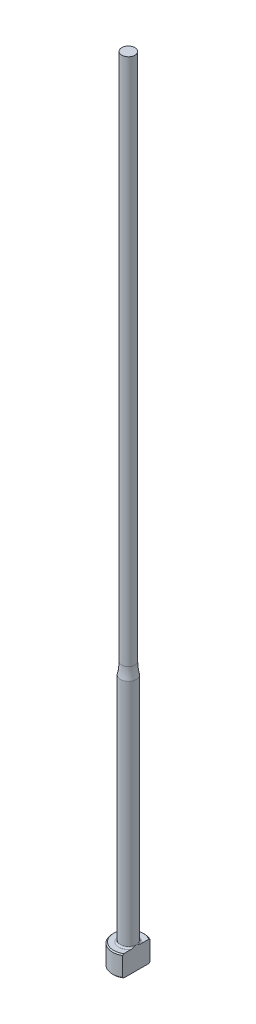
ISO-10303-21;
HEADER;
FILE_DESCRIPTION(('STEP AP214'),'2;1');
FILE_NAME('part.step','',(''),(''),'','','');
FILE_SCHEMA(('AUTOMOTIVE_DESIGN { 1 0 10303 214 1 1 1 1 }'));
ENDSEC;
DATA;
#1=APPLICATION_CONTEXT('core data for automotive mechanical design processes');
#2=APPLICATION_PROTOCOL_DEFINITION('international standard','automotive_design',2000,#1);
#3=PRODUCT_CONTEXT('',#1,'mechanical');
#4=PRODUCT('Part','Part','',(#3));
#5=PRODUCT_RELATED_PRODUCT_CATEGORY('part','',(#4));
#6=PRODUCT_DEFINITION_FORMATION('','',#4);
#7=PRODUCT_DEFINITION_CONTEXT('part definition',#1,'design');
#8=PRODUCT_DEFINITION('design','',#6,#7);
#9=PRODUCT_DEFINITION_SHAPE('','',#8);
#10=(LENGTH_UNIT() NAMED_UNIT(*) SI_UNIT(.MILLI.,.METRE.));
#11=(NAMED_UNIT(*) PLANE_ANGLE_UNIT() SI_UNIT($,.RADIAN.));
#12=(NAMED_UNIT(*) SI_UNIT($,.STERADIAN.) SOLID_ANGLE_UNIT());
#13=UNCERTAINTY_MEASURE_WITH_UNIT(LENGTH_MEASURE(1.E-05),#10,'distance_accuracy_value','');
#14=(GEOMETRIC_REPRESENTATION_CONTEXT(3) GLOBAL_UNCERTAINTY_ASSIGNED_CONTEXT((#13)) GLOBAL_UNIT_ASSIGNED_CONTEXT((#10,
#11,#12)) REPRESENTATION_CONTEXT('',''));
#15=CARTESIAN_POINT('',(0.,0.,0.));
#16=DIRECTION('',(0.,0.,1.));
#17=DIRECTION('',(1.,0.,0.));
#18=AXIS2_PLACEMENT_3D('',#15,#16,#17);
#19=CARTESIAN_POINT('',(-2.99999999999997,4.,0.));
#20=DIRECTION('',(0.,1.,0.));
#21=DIRECTION('',(0.,0.,1.));
#22=AXIS2_PLACEMENT_3D('',#19,#20,#21);
#23=PLANE('',#22);
#24=CARTESIAN_POINT('',(0.,4.,0.));
#25=DIRECTION('',(0.,1.,0.));
#26=DIRECTION('',(0.,0.,1.));
#27=AXIS2_PLACEMENT_3D('',#24,#25,#26);
#28=CIRCLE('',#27,2.79999999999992);
#29=CARTESIAN_POINT('',(1.49999999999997,4.,-2.3643180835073));
#30=VERTEX_POINT('',#29);
#31=CARTESIAN_POINT('',(1.49999999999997,4.,2.3643180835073));
#32=VERTEX_POINT('',#31);
#33=EDGE_CURVE('E187',#30,#32,#28,.T.);
#34=ORIENTED_EDGE('',*,*,#33,.T.);
#35=DIRECTION('',(0.,0.,-1.));
#36=VECTOR('',#35,1.);
#37=CARTESIAN_POINT('',(1.49999999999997,4.,0.));
#38=LINE('',#37,#36);
#39=CARTESIAN_POINT('',(1.49999999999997,4.00000000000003,0.994987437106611));
#40=VERTEX_POINT('',#39);
#41=EDGE_CURVE('E57',#32,#40,#38,.T.);
#42=ORIENTED_EDGE('',*,*,#41,.T.);
#43=CARTESIAN_POINT('',(0.,4.,0.));
#44=DIRECTION('',(0.,1.,0.));
#45=DIRECTION('',(0.,0.,1.));
#46=AXIS2_PLACEMENT_3D('',#43,#44,#45);
#47=CIRCLE('',#46,1.79999999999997);
#48=CARTESIAN_POINT('',(1.49999999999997,4.00000000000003,-0.994987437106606));
#49=VERTEX_POINT('',#48);
#50=EDGE_CURVE('E108',#40,#49,#47,.F.);
#51=ORIENTED_EDGE('',*,*,#50,.T.);
#52=EDGE_CURVE('E137',#49,#30,#38,.T.);
#53=ORIENTED_EDGE('',*,*,#52,.T.);
#54=EDGE_LOOP('',(#34,#42,#51,#53));
#55=FACE_BOUND('',#54,.T.);
#56=ADVANCED_FACE('F32',(#55),#23,.T.);
#57=CARTESIAN_POINT('',(0.,259.958771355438,0.));
#58=DIRECTION('',(0.,1.,0.));
#59=DIRECTION('',(0.,0.,1.));
#60=AXIS2_PLACEMENT_3D('',#57,#58,#59);
#61=CYLINDRICAL_SURFACE('',#60,2.99999999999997);
#62=CARTESIAN_POINT('',(0.,3.79999999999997,0.));
#63=DIRECTION('',(0.,1.,0.));
#64=DIRECTION('',(0.,0.,1.));
#65=AXIS2_PLACEMENT_3D('',#62,#63,#64);
#66=CIRCLE('',#65,2.99999999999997);
#67=CARTESIAN_POINT('',(1.49999999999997,3.79999999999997,2.5980762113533));
#68=VERTEX_POINT('',#67);
#69=CARTESIAN_POINT('',(1.49999999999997,3.79999999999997,-2.5980762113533));
#70=VERTEX_POINT('',#69);
#71=EDGE_CURVE('E105',#68,#70,#66,.F.);
#72=ORIENTED_EDGE('',*,*,#71,.T.);
#73=DIRECTION('',(0.,-1.,0.));
#74=VECTOR('',#73,1.);
#75=CARTESIAN_POINT('',(1.49999999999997,150.,-2.5980762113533));
#76=LINE('',#75,#74);
#77=CARTESIAN_POINT('',(1.49999999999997,0.199999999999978,-2.5980762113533));
#78=VERTEX_POINT('',#77);
#79=EDGE_CURVE('E193',#70,#78,#76,.T.);
#80=ORIENTED_EDGE('',*,*,#79,.T.);
#81=CARTESIAN_POINT('',(0.,0.199999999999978,0.));
#82=DIRECTION('',(0.,-1.,0.));
#83=DIRECTION('',(0.,0.,-1.));
#84=AXIS2_PLACEMENT_3D('',#81,#82,#83);
#85=CIRCLE('',#84,2.99999999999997);
#86=CARTESIAN_POINT('',(1.49999999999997,0.199999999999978,2.5980762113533));
#87=VERTEX_POINT('',#86);
#88=EDGE_CURVE('E100',#78,#87,#85,.F.);
#89=ORIENTED_EDGE('',*,*,#88,.T.);
#90=DIRECTION('',(0.,-1.,0.));
#91=VECTOR('',#90,1.);
#92=CARTESIAN_POINT('',(1.49999999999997,150.,2.5980762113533));
#93=LINE('',#92,#91);
#94=EDGE_CURVE('E93',#68,#87,#93,.T.);
#95=ORIENTED_EDGE('',*,*,#94,.F.);
#96=EDGE_LOOP('',(#72,#80,#89,#95));
#97=FACE_BOUND('',#96,.T.);
#98=ADVANCED_FACE('F158',(#97),#61,.T.);
#99=CARTESIAN_POINT('',(0.,0.,0.));
#100=DIRECTION('',(0.,-1.,0.));
#101=DIRECTION('',(0.,0.,-1.));
#102=AXIS2_PLACEMENT_3D('',#99,#100,#101);
#103=PLANE('',#102);
#104=CARTESIAN_POINT('',(0.,0.,0.));
#105=DIRECTION('',(0.,-1.,0.));
#106=DIRECTION('',(0.,0.,-1.));
#107=AXIS2_PLACEMENT_3D('',#104,#105,#106);
#108=CIRCLE('',#107,2.8);
#109=CARTESIAN_POINT('',(1.49999999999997,0.,2.36431808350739));
#110=VERTEX_POINT('',#109);
#111=CARTESIAN_POINT('',(1.49999999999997,0.,-2.36431808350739));
#112=VERTEX_POINT('',#111);
#113=EDGE_CURVE('E98',#110,#112,#108,.T.);
#114=ORIENTED_EDGE('',*,*,#113,.T.);
#115=DIRECTION('',(0.,0.,1.));
#116=VECTOR('',#115,1.);
#117=CARTESIAN_POINT('',(1.49999999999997,0.,2.5980762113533));
#118=LINE('',#117,#116);
#119=EDGE_CURVE('E83',#112,#110,#118,.T.);
#120=ORIENTED_EDGE('',*,*,#119,.T.);
#121=EDGE_LOOP('',(#114,#120));
#122=FACE_BOUND('',#121,.T.);
#123=ADVANCED_FACE('F103',(#122),#103,.T.);
#124=CARTESIAN_POINT('',(0.,4.,0.));
#125=DIRECTION('',(0.,-1.,0.));
#126=DIRECTION('',(0.,0.,-1.));
#127=AXIS2_PLACEMENT_3D('',#124,#125,#126);
#128=CONICAL_SURFACE('',#127,2.79999999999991,0.7853981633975);
#129=ORIENTED_EDGE('',*,*,#71,.F.);
#130=CARTESIAN_POINT('',(1.49999999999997,0.888258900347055,5.71827621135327));
#131=CARTESIAN_POINT('',(1.49999999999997,1.01361833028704,5.58866816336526));
#132=CARTESIAN_POINT('',(1.49999999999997,1.13884324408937,5.45892957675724));
#133=CARTESIAN_POINT('',(1.49999999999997,1.38894444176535,5.19911365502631));
#134=CARTESIAN_POINT('',(1.49999999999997,1.51382072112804,5.06903631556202));
#135=CARTESIAN_POINT('',(1.49999999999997,1.76320568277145,4.8084018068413));
#136=CARTESIAN_POINT('',(1.49999999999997,1.88771414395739,4.67784442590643));
#137=CARTESIAN_POINT('',(1.49999999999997,2.13618059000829,4.41620813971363));
#138=CARTESIAN_POINT('',(1.49999999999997,2.26013857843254,4.28512923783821));
#139=CARTESIAN_POINT('',(1.49999999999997,2.50488975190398,4.02490837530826));
#140=CARTESIAN_POINT('',(1.49999999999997,2.62569693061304,3.89577958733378));
#141=CARTESIAN_POINT('',(1.49999999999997,2.86640694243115,3.63668213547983));
#142=CARTESIAN_POINT('',(1.49999999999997,2.98630978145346,3.5067134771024));
#143=CARTESIAN_POINT('',(1.49999999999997,3.22486033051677,3.24567921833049));
#144=CARTESIAN_POINT('',(1.49999999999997,3.34350830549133,3.11461386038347));
#145=CARTESIAN_POINT('',(1.49999999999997,3.57907716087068,2.85094268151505));
#146=CARTESIAN_POINT('',(1.49999999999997,3.69599811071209,2.71833692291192));
#147=CARTESIAN_POINT('',(1.49999999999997,3.88262371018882,2.50255231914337));
#148=CARTESIAN_POINT('',(1.49999999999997,3.95312454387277,2.42006293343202));
#149=CARTESIAN_POINT('',(1.49999999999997,4.09287098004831,2.25401084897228));
#150=CARTESIAN_POINT('',(1.49999999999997,4.16211645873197,2.17044804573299));
#151=CARTESIAN_POINT('',(1.49999999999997,4.29964684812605,2.00105967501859));
#152=CARTESIAN_POINT('',(1.49999999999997,4.36791386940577,1.91521952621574));
#153=CARTESIAN_POINT('',(1.49999999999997,4.50205840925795,1.74171392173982));
#154=CARTESIAN_POINT('',(1.49999999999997,4.56793649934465,1.65404891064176));
#155=CARTESIAN_POINT('',(1.49999999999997,4.69728151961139,1.47490236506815));
#156=CARTESIAN_POINT('',(1.49999999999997,4.76069661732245,1.38338308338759));
#157=CARTESIAN_POINT('',(1.49999999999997,4.88239539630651,1.1967566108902));
#158=CARTESIAN_POINT('',(1.49999999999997,4.9406720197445,1.10164473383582));
#159=CARTESIAN_POINT('',(1.49999999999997,5.04841325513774,0.908008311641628));
#160=CARTESIAN_POINT('',(1.49999999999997,5.09797809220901,0.809540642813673));
#161=CARTESIAN_POINT('',(1.49999999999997,5.18432188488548,0.607192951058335));
#162=CARTESIAN_POINT('',(1.49999999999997,5.22114374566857,0.503332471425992));
#163=CARTESIAN_POINT('',(1.49999999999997,5.26099935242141,0.347577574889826));
#164=CARTESIAN_POINT('',(1.49999999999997,5.27157029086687,0.297609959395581));
#165=CARTESIAN_POINT('',(1.49999999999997,5.28794860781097,0.196885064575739));
#166=CARTESIAN_POINT('',(1.49999999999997,5.29375640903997,0.146127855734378));
#167=CARTESIAN_POINT('',(1.49999999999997,5.3001970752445,0.0444388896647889));
#168=CARTESIAN_POINT('',(1.49999999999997,5.3008459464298,-0.00649183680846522));
#169=CARTESIAN_POINT('',(1.49999999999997,5.29696416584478,-0.108155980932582));
#170=CARTESIAN_POINT('',(1.49999999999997,5.29243308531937,-0.158889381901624));
#171=CARTESIAN_POINT('',(1.49999999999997,5.2785691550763,-0.259234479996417));
#172=CARTESIAN_POINT('',(1.49999999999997,5.2692782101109,-0.308852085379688));
#173=CARTESIAN_POINT('',(1.49999999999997,5.24647108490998,-0.40711049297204));
#174=CARTESIAN_POINT('',(1.49999999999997,5.23295324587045,-0.455750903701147));
#175=CARTESIAN_POINT('',(1.49999999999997,5.20226175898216,-0.552149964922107));
#176=CARTESIAN_POINT('',(1.49999999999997,5.18506801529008,-0.5999021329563));
#177=CARTESIAN_POINT('',(1.49999999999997,5.14771387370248,-0.694205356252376));
#178=CARTESIAN_POINT('',(1.49999999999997,5.12755408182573,-0.740756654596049));
#179=CARTESIAN_POINT('',(1.49999999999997,5.06327696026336,-0.879166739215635));
#180=CARTESIAN_POINT('',(1.49999999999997,5.01551721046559,-0.969329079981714));
#181=CARTESIAN_POINT('',(1.49999999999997,4.91367909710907,-1.1460431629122));
#182=CARTESIAN_POINT('',(1.49999999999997,4.85959300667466,-1.23259031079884));
#183=CARTESIAN_POINT('',(1.49999999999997,4.74697968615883,-1.40321348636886));
#184=CARTESIAN_POINT('',(1.49999999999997,4.68843573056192,-1.48727838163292));
#185=CARTESIAN_POINT('',(1.49999999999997,4.56843845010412,-1.6532218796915));
#186=CARTESIAN_POINT('',(1.49999999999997,4.50698656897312,-1.73510153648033));
#187=CARTESIAN_POINT('',(1.49999999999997,4.38115673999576,-1.89829823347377));
#188=CARTESIAN_POINT('',(1.49999999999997,4.31675092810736,-1.9795936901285));
#189=CARTESIAN_POINT('',(1.49999999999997,4.18634068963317,-2.14090082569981));
#190=CARTESIAN_POINT('',(1.49999999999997,4.12033609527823,-2.22091236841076));
#191=CARTESIAN_POINT('',(1.49999999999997,3.92086431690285,-2.45906508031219));
#192=CARTESIAN_POINT('',(1.49999999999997,3.78562663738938,-2.61572090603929));
#193=CARTESIAN_POINT('',(1.49999999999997,3.53554498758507,-2.90006295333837));
#194=CARTESIAN_POINT('',(1.49999999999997,3.42114543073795,-3.02814382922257));
#195=CARTESIAN_POINT('',(1.49999999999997,3.19093557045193,-3.28303767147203));
#196=CARTESIAN_POINT('',(1.49999999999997,3.07512522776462,-3.40985060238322));
#197=CARTESIAN_POINT('',(1.49999999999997,2.72597067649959,-3.78913849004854));
#198=CARTESIAN_POINT('',(1.49999999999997,2.49111760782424,-4.04022177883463));
#199=CARTESIAN_POINT('',(1.49999999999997,2.02882478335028,-4.52992803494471));
#200=CARTESIAN_POINT('',(1.49999999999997,1.80147747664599,-4.76863870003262));
#201=CARTESIAN_POINT('',(1.49999999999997,1.45954865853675,-5.12558036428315));
#202=CARTESIAN_POINT('',(1.49999999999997,1.34548484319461,-5.24430773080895));
#203=CARTESIAN_POINT('',(1.49999999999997,1.11707176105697,-5.48148573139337));
#204=CARTESIAN_POINT('',(1.49999999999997,1.00272249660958,-5.59993636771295));
#205=CARTESIAN_POINT('',(1.49999999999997,0.888258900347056,-5.71827621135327));
#206=B_SPLINE_CURVE_WITH_KNOTS('',3,(#130,#131,#132,#133,#134,#135,#136,#137,#138,#139,#140,
#141,#142,#143,#144,#145,#146,#147,#148,#149,#150,#151,#152,#153,#154,#155,#156,#157,#158,#159,
#160,#161,#162,#163,#164,#165,#166,#167,#168,#169,#170,#171,#172,#173,#174,#175,#176,#177,#178,
#179,#180,#181,#182,#183,#184,#185,#186,#187,#188,#189,#190,#191,#192,#193,#194,#195,#196,#197,
#198,#199,#200,#201,#202,#203,#204,#205),.UNSPECIFIED.,.F.,.F.,(4,2,2,2,2,2,2,2,2,2,2,2,2,2,2,2,
2,2,2,2,2,2,2,2,2,2,2,2,2,2,2,2,2,2,2,2,2,4),(0.,0.540943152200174,1.08189327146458,
1.62312052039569,2.16434426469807,2.69482920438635,3.22531067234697,3.75567781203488,
4.28602356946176,4.61155053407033,4.93710943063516,5.26610945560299,5.59503024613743,
5.92894782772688,6.26331713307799,6.59354403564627,6.92264800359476,7.07567478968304,
7.22868799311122,7.38122626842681,7.53377717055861,7.68500755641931,7.83629736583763,
7.98843643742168,8.14054446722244,8.4461879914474,8.75220879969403,9.05944044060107,
9.366521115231,9.677642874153,9.98879742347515,10.6095925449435,11.1247803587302,
11.6399825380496,12.6713544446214,13.6603005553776,14.1542238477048,14.648143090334),.UNSPECIFIED.);
#207=EDGE_CURVE('E136',#68,#32,#206,.T.);
#208=ORIENTED_EDGE('',*,*,#207,.T.);
#209=ORIENTED_EDGE('',*,*,#33,.F.);
#210=EDGE_CURVE('E128',#30,#70,#206,.T.);
#211=ORIENTED_EDGE('',*,*,#210,.T.);
#212=EDGE_LOOP('',(#129,#208,#209,#211));
#213=FACE_BOUND('',#212,.T.);
#214=ADVANCED_FACE('F144',(#213),#128,.T.);
#215=CARTESIAN_POINT('',(0.,0.199999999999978,0.));
#216=DIRECTION('',(0.,1.,0.));
#217=DIRECTION('',(0.,0.,1.));
#218=AXIS2_PLACEMENT_3D('',#215,#216,#217);
#219=CONICAL_SURFACE('',#218,2.99999999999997,0.785398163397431);
#220=ORIENTED_EDGE('',*,*,#88,.F.);
#221=CARTESIAN_POINT('',(1.49999999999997,3.1117410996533,-5.71827621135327));
#222=CARTESIAN_POINT('',(1.49999999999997,2.98638166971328,-5.58866816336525));
#223=CARTESIAN_POINT('',(1.49999999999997,2.86115675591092,-5.45892957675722));
#224=CARTESIAN_POINT('',(1.49999999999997,2.61105555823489,-5.19911365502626));
#225=CARTESIAN_POINT('',(1.49999999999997,2.48617927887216,-5.06903631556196));
#226=CARTESIAN_POINT('',(1.49999999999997,2.23679431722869,-4.80840180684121));
#227=CARTESIAN_POINT('',(1.49999999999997,2.11228585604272,-4.67784442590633));
#228=CARTESIAN_POINT('',(1.49999999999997,1.86381940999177,-4.4162081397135));
#229=CARTESIAN_POINT('',(1.49999999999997,1.73986142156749,-4.28512923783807));
#230=CARTESIAN_POINT('',(1.49999999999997,1.49511024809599,-4.02490837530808));
#231=CARTESIAN_POINT('',(1.49999999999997,1.3743030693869,-3.8957795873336));
#232=CARTESIAN_POINT('',(1.49999999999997,1.13359305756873,-3.63668213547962));
#233=CARTESIAN_POINT('',(1.49999999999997,1.0136902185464,-3.50671347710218));
#234=CARTESIAN_POINT('',(1.49999999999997,0.77513966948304,-3.24567921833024));
#235=CARTESIAN_POINT('',(1.49999999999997,0.656491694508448,-3.11461386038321));
#236=CARTESIAN_POINT('',(1.49999999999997,0.420922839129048,-2.85094268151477));
#237=CARTESIAN_POINT('',(1.49999999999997,0.30400188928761,-2.71833692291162));
#238=CARTESIAN_POINT('',(1.49999999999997,0.11737628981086,-2.50255231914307));
#239=CARTESIAN_POINT('',(1.49999999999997,0.046875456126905,-2.42006293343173));
#240=CARTESIAN_POINT('',(1.49999999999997,-0.0928709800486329,-2.254010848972));
#241=CARTESIAN_POINT('',(1.49999999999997,-0.162116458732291,-2.17044804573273));
#242=CARTESIAN_POINT('',(1.49999999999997,-0.299646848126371,-2.00105967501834));
#243=CARTESIAN_POINT('',(1.49999999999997,-0.367913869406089,-1.9152195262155));
#244=CARTESIAN_POINT('',(1.49999999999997,-0.502058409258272,-1.7417139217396));
#245=CARTESIAN_POINT('',(1.49999999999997,-0.567936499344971,-1.65404891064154));
#246=CARTESIAN_POINT('',(1.49999999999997,-0.697281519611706,-1.47490236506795));
#247=CARTESIAN_POINT('',(1.49999999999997,-0.76069661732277,-1.38338308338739));
#248=CARTESIAN_POINT('',(1.49999999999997,-0.882395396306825,-1.19675661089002));
#249=CARTESIAN_POINT('',(1.49999999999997,-0.940672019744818,-1.10164473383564));
#250=CARTESIAN_POINT('',(1.49999999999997,-1.04841325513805,-0.908008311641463));
#251=CARTESIAN_POINT('',(1.49999999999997,-1.09797809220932,-0.809540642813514));
#252=CARTESIAN_POINT('',(1.49999999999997,-1.18432188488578,-0.607192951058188));
#253=CARTESIAN_POINT('',(1.49999999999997,-1.22114374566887,-0.50333247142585));
#254=CARTESIAN_POINT('',(1.49999999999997,-1.26099935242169,-0.347577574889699));
#255=CARTESIAN_POINT('',(1.49999999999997,-1.27157029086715,-0.297609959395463));
#256=CARTESIAN_POINT('',(1.49999999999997,-1.28794860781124,-0.196885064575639));
#257=CARTESIAN_POINT('',(1.49999999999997,-1.29375640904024,-0.146127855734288));
#258=CARTESIAN_POINT('',(1.49999999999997,-1.30019707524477,-0.0444388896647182));
#259=CARTESIAN_POINT('',(1.49999999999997,-1.30084594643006,0.00649183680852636));
#260=CARTESIAN_POINT('',(1.49999999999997,-1.29696416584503,0.108155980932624));
#261=CARTESIAN_POINT('',(1.49999999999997,-1.29243308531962,0.158889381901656));
#262=CARTESIAN_POINT('',(1.49999999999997,-1.27856915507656,0.25923447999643));
#263=CARTESIAN_POINT('',(1.49999999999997,-1.26927821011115,0.308852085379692));
#264=CARTESIAN_POINT('',(1.49999999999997,-1.24647108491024,0.407110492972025));
#265=CARTESIAN_POINT('',(1.49999999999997,-1.2329532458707,0.455750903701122));
#266=CARTESIAN_POINT('',(1.49999999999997,-1.20226175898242,0.552149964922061));
#267=CARTESIAN_POINT('',(1.49999999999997,-1.18506801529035,0.599902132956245));
#268=CARTESIAN_POINT('',(1.49999999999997,-1.14771387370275,0.694205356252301));
#269=CARTESIAN_POINT('',(1.49999999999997,-1.12755408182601,0.740756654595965));
#270=CARTESIAN_POINT('',(1.49999999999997,-1.06327696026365,0.879166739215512));
#271=CARTESIAN_POINT('',(1.49999999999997,-1.0155172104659,0.969329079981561));
#272=CARTESIAN_POINT('',(1.49999999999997,-0.913679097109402,1.14604316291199));
#273=CARTESIAN_POINT('',(1.49999999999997,-0.859593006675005,1.2325903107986));
#274=CARTESIAN_POINT('',(1.49999999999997,-0.746979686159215,1.40321348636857));
#275=CARTESIAN_POINT('',(1.49999999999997,-0.688435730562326,1.4872783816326));
#276=CARTESIAN_POINT('',(1.49999999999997,-0.568438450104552,1.65322187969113));
#277=CARTESIAN_POINT('',(1.49999999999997,-0.506986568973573,1.73510153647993));
#278=CARTESIAN_POINT('',(1.49999999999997,-0.381156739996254,1.89829823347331));
#279=CARTESIAN_POINT('',(1.49999999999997,-0.316750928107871,1.97959369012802));
#280=CARTESIAN_POINT('',(1.49999999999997,-0.18634068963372,2.14090082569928));
#281=CARTESIAN_POINT('',(1.49999999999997,-0.120336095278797,2.22091236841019));
#282=CARTESIAN_POINT('',(1.49999999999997,0.0791356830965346,2.45906508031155));
#283=CARTESIAN_POINT('',(1.49999999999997,0.214373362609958,2.61572090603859));
#284=CARTESIAN_POINT('',(1.49999999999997,0.464455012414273,2.90006295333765));
#285=CARTESIAN_POINT('',(1.49999999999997,0.578854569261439,3.02814382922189));
#286=CARTESIAN_POINT('',(1.49999999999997,0.809064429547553,3.28303767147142));
#287=CARTESIAN_POINT('',(1.49999999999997,0.924874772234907,3.40985060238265));
#288=CARTESIAN_POINT('',(1.49999999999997,1.27402932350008,3.78913849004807));
#289=CARTESIAN_POINT('',(1.49999999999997,1.50888239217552,4.04022177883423));
#290=CARTESIAN_POINT('',(1.49999999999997,1.97117521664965,4.52992803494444));
#291=CARTESIAN_POINT('',(1.49999999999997,2.19852252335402,4.76863870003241));
#292=CARTESIAN_POINT('',(1.49999999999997,2.54045134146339,5.12558036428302));
#293=CARTESIAN_POINT('',(1.49999999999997,2.65451515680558,5.24430773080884));
#294=CARTESIAN_POINT('',(1.49999999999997,2.8829282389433,5.48148573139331));
#295=CARTESIAN_POINT('',(1.49999999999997,2.99727750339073,5.59993636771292));
#296=CARTESIAN_POINT('',(1.49999999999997,3.1117410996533,5.71827621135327));
#297=B_SPLINE_CURVE_WITH_KNOTS('',3,(#221,#222,#223,#224,#225,#226,#227,#228,#229,#230,#231,
#232,#233,#234,#235,#236,#237,#238,#239,#240,#241,#242,#243,#244,#245,#246,#247,#248,#249,#250,
#251,#252,#253,#254,#255,#256,#257,#258,#259,#260,#261,#262,#263,#264,#265,#266,#267,#268,#269,
#270,#271,#272,#273,#274,#275,#276,#277,#278,#279,#280,#281,#282,#283,#284,#285,#286,#287,#288,
#289,#290,#291,#292,#293,#294,#295,#296),.UNSPECIFIED.,.F.,.F.,(4,2,2,2,2,2,2,2,2,2,2,2,2,2,2,2,
2,2,2,2,2,2,2,2,2,2,2,2,2,2,2,2,2,2,2,2,2,4),(0.,0.540943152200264,1.08189327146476,
1.62312052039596,2.16434426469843,2.69482920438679,3.22531067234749,3.75567781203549,
4.28602356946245,4.611550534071,4.9371094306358,5.26610945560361,5.59503024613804,
5.92894782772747,6.26331713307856,6.59354403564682,6.92264800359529,7.07567478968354,
7.22868799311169,7.38122626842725,7.53377717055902,7.6850075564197,7.83629736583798,
7.98843643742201,8.14054446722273,8.44618799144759,8.75220879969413,9.05944044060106,
9.3665211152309,9.6776428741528,9.98879742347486,10.609592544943,11.1247803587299,
11.6399825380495,12.6713544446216,13.6603005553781,14.1542238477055,14.6481430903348),.UNSPECIFIED.);
#298=EDGE_CURVE('E86',#78,#112,#297,.T.);
#299=ORIENTED_EDGE('',*,*,#298,.T.);
#300=ORIENTED_EDGE('',*,*,#113,.F.);
#301=EDGE_CURVE('E89',#110,#87,#297,.T.);
#302=ORIENTED_EDGE('',*,*,#301,.T.);
#303=EDGE_LOOP('',(#220,#299,#300,#302));
#304=FACE_BOUND('',#303,.T.);
#305=ADVANCED_FACE('F97',(#304),#219,.T.);
#306=CARTESIAN_POINT('',(0.,4.30000000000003,0.));
#307=DIRECTION('',(0.,1.,0.));
#308=DIRECTION('',(0.,0.,1.));
#309=AXIS2_PLACEMENT_3D('',#306,#307,#308);
#310=TOROIDAL_SURFACE('',#309,1.79999999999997,0.3);
#311=CARTESIAN_POINT('',(1.49999999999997,4.30000000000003,0.));
#312=CARTESIAN_POINT('',(1.49999999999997,4.30000063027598,3.41945444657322E-12));
#313=CARTESIAN_POINT('',(1.49999999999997,4.30000126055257,-1.15373636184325E-07));
#314=CARTESIAN_POINT('',(1.49999999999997,4.30000248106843,-4.90631569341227E-07));
#315=CARTESIAN_POINT('',(1.49999999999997,4.30000307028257,-7.53296664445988E-07));
#316=CARTESIAN_POINT('',(1.49999999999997,4.30000424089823,-1.38757095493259E-06));
#317=CARTESIAN_POINT('',(1.49999999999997,4.30000481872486,-1.76563000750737E-06));
#318=CARTESIAN_POINT('',(1.49999999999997,4.30000591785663,-2.58768006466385E-06));
#319=CARTESIAN_POINT('',(1.49999999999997,4.30000643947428,-3.03127013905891E-06));
#320=CARTESIAN_POINT('',(1.49999999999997,4.30000815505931,-4.60021967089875E-06));
#321=CARTESIAN_POINT('',(1.49999999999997,4.30000927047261,-5.81241520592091E-06));
#322=CARTESIAN_POINT('',(1.49999999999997,4.30001128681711,-8.33989414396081E-06));
#323=CARTESIAN_POINT('',(1.49999999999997,4.30001219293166,-9.65128158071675E-06));
#324=CARTESIAN_POINT('',(1.49999999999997,4.30001551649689,-1.46782506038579E-05));
#325=CARTESIAN_POINT('',(1.49999999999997,4.30001775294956,-1.85179769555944E-05));
#326=CARTESIAN_POINT('',(1.49999999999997,4.30002148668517,-2.61616194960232E-05));
#327=CARTESIAN_POINT('',(1.49999999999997,4.30002302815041,-2.99447742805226E-05));
#328=CARTESIAN_POINT('',(1.49999999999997,4.30002943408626,-4.58003745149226E-05));
#329=CARTESIAN_POINT('',(1.49999999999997,4.3000341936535,-5.79079080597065E-05));
#330=CARTESIAN_POINT('',(1.49999999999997,4.30004197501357,-8.07263758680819E-05));
#331=CARTESIAN_POINT('',(1.49999999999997,4.30004514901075,-9.13834712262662E-05));
#332=CARTESIAN_POINT('',(1.49999999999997,4.30006989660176,-0.000167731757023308));
#333=CARTESIAN_POINT('',(1.49999999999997,4.30010092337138,-0.000229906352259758));
#334=CARTESIAN_POINT('',(1.49999999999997,4.30021632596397,-0.000470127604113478));
#335=CARTESIAN_POINT('',(1.49999999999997,4.30029368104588,-0.000650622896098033));
#336=CARTESIAN_POINT('',(1.49999999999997,4.30059619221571,-0.00134589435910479));
#337=CARTESIAN_POINT('',(1.49999999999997,4.30082870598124,-0.00185814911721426));
#338=CARTESIAN_POINT('',(1.49999999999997,4.30176696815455,-0.0039354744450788));
#339=CARTESIAN_POINT('',(1.49999999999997,4.30246445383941,-0.00550332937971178));
#340=CARTESIAN_POINT('',(1.49999999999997,4.31426785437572,-0.0320229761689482));
#341=CARTESIAN_POINT('',(1.49999999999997,4.3254480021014,-0.0569503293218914));
#342=CARTESIAN_POINT('',(1.49999999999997,4.34725700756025,-0.105984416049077));
#343=CARTESIAN_POINT('',(1.49999999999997,4.35789134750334,-0.130088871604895));
#344=CARTESIAN_POINT('',(1.49999999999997,4.38015321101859,-0.181096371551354));
#345=CARTESIAN_POINT('',(1.49999999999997,4.39175804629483,-0.208009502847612));
#346=CARTESIAN_POINT('',(1.49999999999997,4.41469034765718,-0.262264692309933));
#347=CARTESIAN_POINT('',(1.49999999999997,4.42601398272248,-0.289608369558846));
#348=CARTESIAN_POINT('',(1.49999999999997,4.45363212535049,-0.358203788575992));
#349=CARTESIAN_POINT('',(1.49999999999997,4.46959026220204,-0.399592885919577));
#350=CARTESIAN_POINT('',(1.49999999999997,4.49940505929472,-0.48209793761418));
#351=CARTESIAN_POINT('',(1.49999999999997,4.51330033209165,-0.523199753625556));
#352=CARTESIAN_POINT('',(1.49999999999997,4.53552507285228,-0.595497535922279));
#353=CARTESIAN_POINT('',(1.49999999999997,4.54436834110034,-0.626532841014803));
#354=CARTESIAN_POINT('',(1.49999999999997,4.56052427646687,-0.689176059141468));
#355=CARTESIAN_POINT('',(1.49999999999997,4.56782794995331,-0.720786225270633));
#356=CARTESIAN_POINT('',(1.49999999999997,4.5875075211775,-0.819524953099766));
#357=CARTESIAN_POINT('',(1.49999999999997,4.59661044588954,-0.887429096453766));
#358=CARTESIAN_POINT('',(1.49999999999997,4.60059842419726,-0.991180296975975));
#359=CARTESIAN_POINT('',(1.49999999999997,4.60019840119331,-1.02684364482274));
#360=CARTESIAN_POINT('',(1.49999999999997,4.59497085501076,-1.09750559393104));
#361=CARTESIAN_POINT('',(1.49999999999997,4.59019295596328,-1.13250716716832));
#362=CARTESIAN_POINT('',(1.49999999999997,4.57687734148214,-1.19353096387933));
#363=CARTESIAN_POINT('',(1.49999999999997,4.56943875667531,-1.21978854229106));
#364=CARTESIAN_POINT('',(1.49999999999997,4.55063748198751,-1.27094658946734));
#365=CARTESIAN_POINT('',(1.49999999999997,4.53927342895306,-1.29584658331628));
#366=CARTESIAN_POINT('',(1.49999999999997,4.51660016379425,-1.33501873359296));
#367=CARTESIAN_POINT('',(1.49999999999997,4.50657738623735,-1.35003296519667));
#368=CARTESIAN_POINT('',(1.49999999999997,4.48437469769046,-1.37837252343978));
#369=CARTESIAN_POINT('',(1.49999999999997,4.47219867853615,-1.3917008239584));
#370=CARTESIAN_POINT('',(1.49999999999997,4.4483561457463,-1.4134941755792));
#371=CARTESIAN_POINT('',(1.49999999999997,4.43709185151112,-1.42239673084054));
#372=CARTESIAN_POINT('',(1.49999999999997,4.41325256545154,-1.43825467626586));
#373=CARTESIAN_POINT('',(1.49999999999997,4.40067804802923,-1.44521076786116));
#374=CARTESIAN_POINT('',(1.49999999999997,4.37433767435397,-1.45677158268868));
#375=CARTESIAN_POINT('',(1.49999999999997,4.36056203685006,-1.46135438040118));
#376=CARTESIAN_POINT('',(1.49999999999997,4.33237324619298,-1.46767730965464));
#377=CARTESIAN_POINT('',(1.49999999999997,4.3179607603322,-1.46942034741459));
#378=CARTESIAN_POINT('',(1.49999999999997,4.29122479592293,-1.4698720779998));
#379=CARTESIAN_POINT('',(1.49999999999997,4.27890664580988,-1.468990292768));
#380=CARTESIAN_POINT('',(1.49999999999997,4.25461019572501,-1.4651157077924));
#381=CARTESIAN_POINT('',(1.49999999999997,4.24263187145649,-1.46212305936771));
#382=CARTESIAN_POINT('',(1.49999999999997,4.21959683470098,-1.4543117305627));
#383=CARTESIAN_POINT('',(1.49999999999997,4.20852542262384,-1.44953579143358));
#384=CARTESIAN_POINT('',(1.49999999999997,4.18721125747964,-1.43840957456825));
#385=CARTESIAN_POINT('',(1.49999999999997,4.17696878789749,-1.43205876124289));
#386=CARTESIAN_POINT('',(1.49999999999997,4.15325976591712,-1.41506353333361));
#387=CARTESIAN_POINT('',(1.49999999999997,4.14027750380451,-1.40374235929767));
#388=CARTESIAN_POINT('',(1.49999999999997,4.11630720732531,-1.37914825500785));
#389=CARTESIAN_POINT('',(1.49999999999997,4.10532420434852,-1.36587054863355));
#390=CARTESIAN_POINT('',(1.49999999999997,4.08100891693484,-1.33197272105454));
#391=CARTESIAN_POINT('',(1.49999999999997,4.06867625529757,-1.31063843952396));
#392=CARTESIAN_POINT('',(1.49999999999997,4.04751867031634,-1.26637455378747));
#393=CARTESIAN_POINT('',(1.49999999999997,4.03869240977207,-1.24344556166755));
#394=CARTESIAN_POINT('',(1.49999999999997,4.01978360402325,-1.18316534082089));
#395=CARTESIAN_POINT('',(1.49999999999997,4.01191472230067,-1.14512623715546));
#396=CARTESIAN_POINT('',(1.49999999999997,4.00188285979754,-1.06789971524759));
#397=CARTESIAN_POINT('',(1.49999999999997,3.99979735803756,-1.02870374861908));
#398=CARTESIAN_POINT('',(1.49999999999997,4.00021727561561,-0.953160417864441));
#399=CARTESIAN_POINT('',(1.49999999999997,4.00240673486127,-0.916808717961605));
#400=CARTESIAN_POINT('',(1.49999999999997,4.00996433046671,-0.844432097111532));
#401=CARTESIAN_POINT('',(1.49999999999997,4.01533462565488,-0.808407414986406));
#402=CARTESIAN_POINT('',(1.49999999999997,4.02828086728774,-0.738670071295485));
#403=CARTESIAN_POINT('',(1.49999999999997,4.03573028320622,-0.704933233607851));
#404=CARTESIAN_POINT('',(1.49999999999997,4.05243174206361,-0.638128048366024));
#405=CARTESIAN_POINT('',(1.49999999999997,4.06167285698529,-0.605056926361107));
#406=CARTESIAN_POINT('',(1.49999999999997,4.08440652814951,-0.530195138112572));
#407=CARTESIAN_POINT('',(1.49999999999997,4.0983657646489,-0.488547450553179));
#408=CARTESIAN_POINT('',(1.49999999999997,4.12838209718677,-0.404954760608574));
#409=CARTESIAN_POINT('',(1.49999999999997,4.14447968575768,-0.36302453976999));
#410=CARTESIAN_POINT('',(1.49999999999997,4.17238454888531,-0.293508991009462));
#411=CARTESIAN_POINT('',(1.49999999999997,4.18384249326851,-0.265781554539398));
#412=CARTESIAN_POINT('',(1.49999999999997,4.20705854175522,-0.210769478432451));
#413=CARTESIAN_POINT('',(1.49999999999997,4.21881265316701,-0.183483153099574));
#414=CARTESIAN_POINT('',(1.49999999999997,4.24136702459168,-0.131772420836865));
#415=CARTESIAN_POINT('',(1.49999999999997,4.25214361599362,-0.10733750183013));
#416=CARTESIAN_POINT('',(1.49999999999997,4.27424746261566,-0.0576321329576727));
#417=CARTESIAN_POINT('',(1.49999999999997,4.28558038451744,-0.0323640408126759));
#418=CARTESIAN_POINT('',(1.49999999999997,4.29753556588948,-0.00550327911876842));
#419=CARTESIAN_POINT('',(1.49999999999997,4.29823307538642,-0.00393537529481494));
#420=CARTESIAN_POINT('',(1.49999999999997,4.2991713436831,-0.00185803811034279));
#421=CARTESIAN_POINT('',(1.49999999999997,4.29940384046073,-0.00134582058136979));
#422=CARTESIAN_POINT('',(1.49999999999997,4.29970633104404,-0.000650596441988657));
#423=CARTESIAN_POINT('',(1.49999999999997,4.29978368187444,-0.000470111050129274));
#424=CARTESIAN_POINT('',(1.49999999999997,4.29989907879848,-0.000229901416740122));
#425=CARTESIAN_POINT('',(1.49999999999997,4.29993010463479,-0.000167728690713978));
#426=CARTESIAN_POINT('',(1.49999999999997,4.29995485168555,-9.13825695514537E-05));
#427=CARTESIAN_POINT('',(1.49999999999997,4.29995802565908,-8.07256246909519E-05));
#428=CARTESIAN_POINT('',(1.49999999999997,4.29996580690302,-5.79074825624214E-05));
#429=CARTESIAN_POINT('',(1.49999999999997,4.29997056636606,-4.58001201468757E-05));
#430=CARTESIAN_POINT('',(1.49999999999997,4.29997697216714,-2.99447122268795E-05));
#431=CARTESIAN_POINT('',(1.49999999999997,4.29997851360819,-2.61615819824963E-05));
#432=CARTESIAN_POINT('',(1.49999999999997,4.29998224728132,-1.85179847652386E-05));
#433=CARTESIAN_POINT('',(1.49999999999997,4.29998448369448,-1.46782784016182E-05));
#434=CARTESIAN_POINT('',(1.49999999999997,4.29998780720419,-9.65132765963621E-06));
#435=CARTESIAN_POINT('',(1.49999999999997,4.29998871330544,-8.33994215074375E-06));
#436=CARTESIAN_POINT('',(1.49999999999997,4.29999072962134,-5.81246437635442E-06));
#437=CARTESIAN_POINT('',(1.49999999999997,4.29999184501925,-4.60026797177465E-06));
#438=CARTESIAN_POINT('',(1.49999999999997,4.29999356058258,-3.03131401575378E-06));
#439=CARTESIAN_POINT('',(1.49999999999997,4.29999408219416,-2.5877220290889E-06));
#440=CARTESIAN_POINT('',(1.49999999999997,4.29999518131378,-1.76566706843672E-06));
#441=CARTESIAN_POINT('',(1.49999999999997,4.29999575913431,-1.38760501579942E-06));
#442=CARTESIAN_POINT('',(1.49999999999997,4.29999692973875,-7.53323456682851E-07));
#443=CARTESIAN_POINT('',(1.49999999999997,4.29999751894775,-4.9065421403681E-07));
#444=CARTESIAN_POINT('',(1.49999999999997,4.2999987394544,-1.15386277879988E-07));
#445=CARTESIAN_POINT('',(1.49999999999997,4.2999993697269,-3.41943909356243E-12));
#446=CARTESIAN_POINT('',(1.49999999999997,4.30000000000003,0.));
#447=B_SPLINE_CURVE_WITH_KNOTS('',3,(#311,#312,#313,#314,#315,#316,#317,#318,#319,#320,#321,
#322,#323,#324,#325,#326,#327,#328,#329,#330,#331,#332,#333,#334,#335,#336,#337,#338,#339,#340,
#341,#342,#343,#344,#345,#346,#347,#348,#349,#350,#351,#352,#353,#354,#355,#356,#357,#358,#359,
#360,#361,#362,#363,#364,#365,#366,#367,#368,#369,#370,#371,#372,#373,#374,#375,#376,#377,#378,
#379,#380,#381,#382,#383,#384,#385,#386,#387,#388,#389,#390,#391,#392,#393,#394,#395,#396,#397,
#398,#399,#400,#401,#402,#403,#404,#405,#406,#407,#408,#409,#410,#411,#412,#413,#414,#415,#416,
#417,#418,#419,#420,#421,#422,#423,#424,#425,#426,#427,#428,#429,#430,#431,#432,#433,#434,#435,
#436,#437,#438,#439,#440,#441,#442,#443,#444,#445,#446),.UNSPECIFIED.,.T.,.F.,(4,2,2,2,2,2,2,2,
2,2,2,2,2,2,2,2,2,2,2,2,2,2,2,2,2,2,2,2,2,2,2,2,2,2,2,2,2,2,2,2,2,2,2,2,2,2,2,2,2,2,2,2,2,2,2,2,
2,2,2,2,2,2,2,2,2,2,2,4),(0.,1.88906030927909E-06,3.81509580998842E-06,5.87892822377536E-06,
7.93062004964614E-06,1.28480887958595E-05,1.76261714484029E-05,3.0909918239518E-05,
4.31529746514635E-05,8.2169932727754E-05,0.000115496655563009,0.000323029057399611,
0.000912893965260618,0.00259963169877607,0.00774858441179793,0.0896975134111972,
0.168737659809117,0.256660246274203,0.345444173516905,0.478492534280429,0.60860395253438,
0.705372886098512,0.802692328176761,1.00719557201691,1.11399616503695,1.21960092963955,
1.30124317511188,1.38291380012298,1.43690814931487,1.49080588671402,1.53371524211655,
1.57660911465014,1.61989249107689,1.66313154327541,1.69999492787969,1.73685567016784,
1.77288440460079,1.80892540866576,1.86031324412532,1.91182866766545,1.98534297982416,
2.05882922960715,2.17471722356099,2.29215041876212,2.40123170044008,2.51038710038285,
2.61397263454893,2.71694519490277,2.84866234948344,2.98337525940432,3.07337666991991,
3.16250453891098,3.24262397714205,3.3256930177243,3.33084213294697,3.33252874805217,
3.33311858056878,3.33332610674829,3.33335943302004,3.33339844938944,3.3334106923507,
3.3334239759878,3.33342875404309,3.33343367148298,3.33343572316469,3.33343778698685,
3.33343971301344,3.33344160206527),.UNSPECIFIED.);
#448=CARTESIAN_POINT('',(1.49999999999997,4.30000000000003,0.));
#449=VERTEX_POINT('',#448);
#450=EDGE_CURVE('E11',#49,#449,#447,.T.);
#451=ORIENTED_EDGE('',*,*,#450,.F.);
#452=ORIENTED_EDGE('',*,*,#50,.F.);
#453=CARTESIAN_POINT('',(1.49999999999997,4.30000000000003,0.));
#454=CARTESIAN_POINT('',(1.49999999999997,4.29999936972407,-3.4196040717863E-12));
#455=CARTESIAN_POINT('',(1.49999999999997,4.29999873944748,1.15373635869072E-07));
#456=CARTESIAN_POINT('',(1.49999999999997,4.29999751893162,4.90631569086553E-07));
#457=CARTESIAN_POINT('',(1.49999999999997,4.29999692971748,7.53296664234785E-07));
#458=CARTESIAN_POINT('',(1.49999999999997,4.29999575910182,1.38757095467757E-06));
#459=CARTESIAN_POINT('',(1.49999999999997,4.2999951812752,1.76563000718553E-06));
#460=CARTESIAN_POINT('',(1.49999999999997,4.29999408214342,2.58768006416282E-06));
#461=CARTESIAN_POINT('',(1.49999999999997,4.29999356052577,3.03127013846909E-06));
#462=CARTESIAN_POINT('',(1.49999999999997,4.29999184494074,4.60021967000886E-06));
#463=CARTESIAN_POINT('',(1.49999999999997,4.29999072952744,5.81241520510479E-06));
#464=CARTESIAN_POINT('',(1.49999999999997,4.29998871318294,8.33989414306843E-06));
#465=CARTESIAN_POINT('',(1.49999999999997,4.29998780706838,9.65128157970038E-06));
#466=CARTESIAN_POINT('',(1.49999999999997,4.29998448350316,1.46782506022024E-05));
#467=CARTESIAN_POINT('',(1.49999999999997,4.29998224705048,1.85179769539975E-05));
#468=CARTESIAN_POINT('',(1.49999999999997,4.29997851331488,2.61616194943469E-05));
#469=CARTESIAN_POINT('',(1.49999999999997,4.29997697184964,2.99447742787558E-05));
#470=CARTESIAN_POINT('',(1.49999999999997,4.29997056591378,4.58003745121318E-05));
#471=CARTESIAN_POINT('',(1.49999999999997,4.29996580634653,5.7907908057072E-05));
#472=CARTESIAN_POINT('',(1.49999999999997,4.29995802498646,8.07263758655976E-05));
#473=CARTESIAN_POINT('',(1.49999999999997,4.29995485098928,9.13834712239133E-05));
#474=CARTESIAN_POINT('',(1.49999999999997,4.29993010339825,0.000167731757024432));
#475=CARTESIAN_POINT('',(1.49999999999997,4.29989907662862,0.000229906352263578));
#476=CARTESIAN_POINT('',(1.49999999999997,4.29978367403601,0.000470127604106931));
#477=CARTESIAN_POINT('',(1.49999999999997,4.29970631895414,0.000650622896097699));
#478=CARTESIAN_POINT('',(1.49999999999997,4.2994038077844,0.00134589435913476));
#479=CARTESIAN_POINT('',(1.49999999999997,4.29917129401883,0.00185814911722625));
#480=CARTESIAN_POINT('',(1.49999999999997,4.29823303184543,0.00393547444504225));
#481=CARTESIAN_POINT('',(1.49999999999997,4.29753554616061,0.00550332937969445));
#482=CARTESIAN_POINT('',(1.49999999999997,4.28573214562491,0.0320229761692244));
#483=CARTESIAN_POINT('',(1.49999999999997,4.2745519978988,0.0569503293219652));
#484=CARTESIAN_POINT('',(1.49999999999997,4.25274299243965,0.105984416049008));
#485=CARTESIAN_POINT('',(1.49999999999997,4.24210865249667,0.130088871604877));
#486=CARTESIAN_POINT('',(1.49999999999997,4.21984678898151,0.181096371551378));
#487=CARTESIAN_POINT('',(1.49999999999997,4.20824195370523,0.208009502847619));
#488=CARTESIAN_POINT('',(1.49999999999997,4.18530965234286,0.262264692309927));
#489=CARTESIAN_POINT('',(1.49999999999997,4.17398601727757,0.289608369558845));
#490=CARTESIAN_POINT('',(1.49999999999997,4.14636787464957,0.358203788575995));
#491=CARTESIAN_POINT('',(1.49999999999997,4.13040973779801,0.399592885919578));
#492=CARTESIAN_POINT('',(1.49999999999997,4.10059494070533,0.48209793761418));
#493=CARTESIAN_POINT('',(1.49999999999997,4.0866996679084,0.523199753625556));
#494=CARTESIAN_POINT('',(1.49999999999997,4.06447492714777,0.595497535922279));
#495=CARTESIAN_POINT('',(1.49999999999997,4.05563165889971,0.626532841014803));
#496=CARTESIAN_POINT('',(1.49999999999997,4.03947572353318,0.689176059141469));
#497=CARTESIAN_POINT('',(1.49999999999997,4.03217205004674,0.720786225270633));
#498=CARTESIAN_POINT('',(1.49999999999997,4.01249247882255,0.819524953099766));
#499=CARTESIAN_POINT('',(1.49999999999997,4.00338955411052,0.887429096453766));
#500=CARTESIAN_POINT('',(1.49999999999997,3.99940157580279,0.991180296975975));
#501=CARTESIAN_POINT('',(1.49999999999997,3.99980159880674,1.02684364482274));
#502=CARTESIAN_POINT('',(1.49999999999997,4.0050291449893,1.09750559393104));
#503=CARTESIAN_POINT('',(1.49999999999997,4.00980704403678,1.13250716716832));
#504=CARTESIAN_POINT('',(1.49999999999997,4.02312265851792,1.19353096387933));
#505=CARTESIAN_POINT('',(1.49999999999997,4.03056124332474,1.21978854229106));
#506=CARTESIAN_POINT('',(1.49999999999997,4.04936251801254,1.27094658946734));
#507=CARTESIAN_POINT('',(1.49999999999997,4.06072657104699,1.29584658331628));
#508=CARTESIAN_POINT('',(1.49999999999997,4.0833998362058,1.33501873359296));
#509=CARTESIAN_POINT('',(1.49999999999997,4.0934226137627,1.35003296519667));
#510=CARTESIAN_POINT('',(1.49999999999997,4.1156253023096,1.37837252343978));
#511=CARTESIAN_POINT('',(1.49999999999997,4.1278013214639,1.3917008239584));
#512=CARTESIAN_POINT('',(1.49999999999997,4.15164385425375,1.4134941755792));
#513=CARTESIAN_POINT('',(1.49999999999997,4.16290814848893,1.42239673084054));
#514=CARTESIAN_POINT('',(1.49999999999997,4.18674743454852,1.43825467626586));
#515=CARTESIAN_POINT('',(1.49999999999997,4.19932195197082,1.44521076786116));
#516=CARTESIAN_POINT('',(1.49999999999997,4.22566232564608,1.45677158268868));
#517=CARTESIAN_POINT('',(1.49999999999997,4.23943796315,1.46135438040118));
#518=CARTESIAN_POINT('',(1.49999999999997,4.26762675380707,1.46767730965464));
#519=CARTESIAN_POINT('',(1.49999999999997,4.28203923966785,1.46942034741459));
#520=CARTESIAN_POINT('',(1.49999999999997,4.30877520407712,1.4698720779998));
#521=CARTESIAN_POINT('',(1.49999999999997,4.32109335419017,1.468990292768));
#522=CARTESIAN_POINT('',(1.49999999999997,4.34538980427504,1.4651157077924));
#523=CARTESIAN_POINT('',(1.49999999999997,4.35736812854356,1.46212305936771));
#524=CARTESIAN_POINT('',(1.49999999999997,4.38040316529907,1.4543117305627));
#525=CARTESIAN_POINT('',(1.49999999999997,4.39147457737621,1.44953579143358));
#526=CARTESIAN_POINT('',(1.49999999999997,4.41278874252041,1.43840957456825));
#527=CARTESIAN_POINT('',(1.49999999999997,4.42303121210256,1.43205876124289));
#528=CARTESIAN_POINT('',(1.49999999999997,4.44674023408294,1.41506353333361));
#529=CARTESIAN_POINT('',(1.49999999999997,4.45972249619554,1.40374235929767));
#530=CARTESIAN_POINT('',(1.49999999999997,4.48369279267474,1.37914825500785));
#531=CARTESIAN_POINT('',(1.49999999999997,4.49467579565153,1.36587054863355));
#532=CARTESIAN_POINT('',(1.49999999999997,4.51899108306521,1.33197272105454));
#533=CARTESIAN_POINT('',(1.49999999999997,4.53132374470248,1.31063843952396));
#534=CARTESIAN_POINT('',(1.49999999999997,4.55248132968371,1.26637455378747));
#535=CARTESIAN_POINT('',(1.49999999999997,4.56130759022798,1.24344556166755));
#536=CARTESIAN_POINT('',(1.49999999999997,4.5802163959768,1.18316534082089));
#537=CARTESIAN_POINT('',(1.49999999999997,4.58808527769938,1.14512623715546));
#538=CARTESIAN_POINT('',(1.49999999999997,4.59811714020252,1.06789971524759));
#539=CARTESIAN_POINT('',(1.49999999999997,4.60020264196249,1.02870374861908));
#540=CARTESIAN_POINT('',(1.49999999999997,4.59978272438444,0.953160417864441));
#541=CARTESIAN_POINT('',(1.49999999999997,4.59759326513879,0.916808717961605));
#542=CARTESIAN_POINT('',(1.49999999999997,4.59003566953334,0.844432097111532));
#543=CARTESIAN_POINT('',(1.49999999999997,4.58466537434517,0.808407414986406));
#544=CARTESIAN_POINT('',(1.49999999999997,4.57171913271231,0.738670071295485));
#545=CARTESIAN_POINT('',(1.49999999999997,4.56426971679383,0.704933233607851));
#546=CARTESIAN_POINT('',(1.49999999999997,4.54756825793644,0.638128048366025));
#547=CARTESIAN_POINT('',(1.49999999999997,4.53832714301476,0.605056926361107));
#548=CARTESIAN_POINT('',(1.49999999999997,4.51559347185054,0.530195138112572));
#549=CARTESIAN_POINT('',(1.49999999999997,4.50163423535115,0.488547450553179));
#550=CARTESIAN_POINT('',(1.49999999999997,4.47161790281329,0.404954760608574));
#551=CARTESIAN_POINT('',(1.49999999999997,4.45552031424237,0.36302453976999));
#552=CARTESIAN_POINT('',(1.49999999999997,4.42761545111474,0.293508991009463));
#553=CARTESIAN_POINT('',(1.49999999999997,4.41615750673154,0.265781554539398));
#554=CARTESIAN_POINT('',(1.49999999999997,4.39294145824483,0.210769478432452));
#555=CARTESIAN_POINT('',(1.49999999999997,4.38118734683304,0.183483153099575));
#556=CARTESIAN_POINT('',(1.49999999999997,4.35863297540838,0.131772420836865));
#557=CARTESIAN_POINT('',(1.49999999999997,4.34785638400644,0.107337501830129));
#558=CARTESIAN_POINT('',(1.49999999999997,4.32575253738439,0.0576321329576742));
#559=CARTESIAN_POINT('',(1.49999999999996,4.31441961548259,0.032364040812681));
#560=CARTESIAN_POINT('',(1.49999999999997,4.30246443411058,0.00550327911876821));
#561=CARTESIAN_POINT('',(1.49999999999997,4.30176692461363,0.0039353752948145));
#562=CARTESIAN_POINT('',(1.49999999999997,4.30082865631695,0.00185803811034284));
#563=CARTESIAN_POINT('',(1.49999999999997,4.30059615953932,0.00134582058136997));
#564=CARTESIAN_POINT('',(1.49999999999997,4.30029366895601,0.000650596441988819));
#565=CARTESIAN_POINT('',(1.49999999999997,4.30021631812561,0.000470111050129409));
#566=CARTESIAN_POINT('',(1.49999999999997,4.30010092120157,0.000229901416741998));
#567=CARTESIAN_POINT('',(1.49999999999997,4.30006989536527,0.000167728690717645));
#568=CARTESIAN_POINT('',(1.49999999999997,4.30004514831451,9.13825695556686E-05));
#569=CARTESIAN_POINT('',(1.49999999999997,4.30004197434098,8.07256246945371E-05));
#570=CARTESIAN_POINT('',(1.49999999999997,4.30003419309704,5.79074825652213E-05));
#571=CARTESIAN_POINT('',(1.49999999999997,4.300029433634,4.58001201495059E-05));
#572=CARTESIAN_POINT('',(1.49999999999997,4.30002302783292,2.99447122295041E-05));
#573=CARTESIAN_POINT('',(1.49999999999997,4.30002148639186,2.61615819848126E-05));
#574=CARTESIAN_POINT('',(1.49999999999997,4.30001775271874,1.85179847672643E-05));
#575=CARTESIAN_POINT('',(1.49999999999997,4.30001551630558,1.46782784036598E-05));
#576=CARTESIAN_POINT('',(1.49999999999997,4.30001219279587,9.65132766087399E-06));
#577=CARTESIAN_POINT('',(1.49999999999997,4.30001128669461,8.33994215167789E-06));
#578=CARTESIAN_POINT('',(1.49999999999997,4.30000927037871,5.81246437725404E-06));
#579=CARTESIAN_POINT('',(1.49999999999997,4.3000081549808,4.60026797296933E-06));
#580=CARTESIAN_POINT('',(1.49999999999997,4.30000643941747,3.03131401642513E-06));
#581=CARTESIAN_POINT('',(1.49999999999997,4.3000059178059,2.58772202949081E-06));
#582=CARTESIAN_POINT('',(1.49999999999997,4.30000481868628,1.76566706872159E-06));
#583=CARTESIAN_POINT('',(1.49999999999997,4.30000424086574,1.38760501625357E-06));
#584=CARTESIAN_POINT('',(1.49999999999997,4.3000030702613,7.53323457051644E-07));
#585=CARTESIAN_POINT('',(1.49999999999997,4.3000024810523,4.90654214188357E-07));
#586=CARTESIAN_POINT('',(1.49999999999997,4.30000126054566,1.15386277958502E-07));
#587=CARTESIAN_POINT('',(1.49999999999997,4.30000063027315,3.4195887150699E-12));
#588=CARTESIAN_POINT('',(1.49999999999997,4.30000000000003,0.));
#589=B_SPLINE_CURVE_WITH_KNOTS('',3,(#453,#454,#455,#456,#457,#458,#459,#460,#461,#462,#463,
#464,#465,#466,#467,#468,#469,#470,#471,#472,#473,#474,#475,#476,#477,#478,#479,#480,#481,#482,
#483,#484,#485,#486,#487,#488,#489,#490,#491,#492,#493,#494,#495,#496,#497,#498,#499,#500,#501,
#502,#503,#504,#505,#506,#507,#508,#509,#510,#511,#512,#513,#514,#515,#516,#517,#518,#519,#520,
#521,#522,#523,#524,#525,#526,#527,#528,#529,#530,#531,#532,#533,#534,#535,#536,#537,#538,#539,
#540,#541,#542,#543,#544,#545,#546,#547,#548,#549,#550,#551,#552,#553,#554,#555,#556,#557,#558,
#559,#560,#561,#562,#563,#564,#565,#566,#567,#568,#569,#570,#571,#572,#573,#574,#575,#576,#577,
#578,#579,#580,#581,#582,#583,#584,#585,#586,#587,#588),.UNSPECIFIED.,.T.,.F.,(4,2,2,2,2,2,2,2,
2,2,2,2,2,2,2,2,2,2,2,2,2,2,2,2,2,2,2,2,2,2,2,2,2,2,2,2,2,2,2,2,2,2,2,2,2,2,2,2,2,2,2,2,2,2,2,2,
2,2,2,2,2,2,2,2,2,2,2,4),(0.,1.8890603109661E-06,3.81509581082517E-06,5.87892822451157E-06,
7.9306200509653E-06,1.28480887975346E-05,1.76261714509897E-05,3.09099182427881E-05,
4.31529746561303E-05,8.2169932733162E-05,0.00011549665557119,0.000323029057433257,
0.000912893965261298,0.00259963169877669,0.00774858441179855,0.0896975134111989,
0.16873765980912,0.256660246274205,0.345444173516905,0.47849253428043,0.60860395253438,
0.705372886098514,0.802692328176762,1.00719557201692,1.11399616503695,1.21960092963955,
1.30124317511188,1.38291380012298,1.43690814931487,1.49080588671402,1.53371524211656,
1.57660911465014,1.61989249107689,1.66313154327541,1.69999492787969,1.73685567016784,
1.7728844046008,1.80892540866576,1.86031324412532,1.91182866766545,1.98534297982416,
2.05882922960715,2.17471722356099,2.29215041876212,2.40123170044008,2.51038710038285,
2.61397263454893,2.71694519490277,2.84866234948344,2.98337525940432,3.07337666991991,
3.16250453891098,3.24262397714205,3.3256930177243,3.33084213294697,3.33252874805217,
3.33311858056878,3.33332610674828,3.33335943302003,3.33339844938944,3.3334106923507,
3.3334239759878,3.33342875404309,3.33343367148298,3.33343572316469,3.33343778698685,
3.33343971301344,3.33344160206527),.UNSPECIFIED.);
#590=EDGE_CURVE('E46',#449,#40,#589,.T.);
#591=ORIENTED_EDGE('',*,*,#590,.F.);
#592=CARTESIAN_POINT('',(0.,4.30000000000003,0.));
#593=DIRECTION('',(0.,1.,0.));
#594=DIRECTION('',(0.,0.,1.));
#595=AXIS2_PLACEMENT_3D('',#592,#593,#594);
#596=CIRCLE('',#595,1.49999999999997);
#597=EDGE_CURVE('E104',#449,#449,#596,.T.);
#598=ORIENTED_EDGE('',*,*,#597,.F.);
#599=EDGE_LOOP('',(#451,#452,#591,#598));
#600=FACE_BOUND('',#599,.T.);
#601=ADVANCED_FACE('F34',(#600),#310,.F.);
#602=CARTESIAN_POINT('',(-1.24999999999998,150.,0.));
#603=DIRECTION('',(0.,1.,0.));
#604=DIRECTION('',(0.,0.,1.));
#605=AXIS2_PLACEMENT_3D('',#602,#603,#604);
#606=PLANE('',#605);
#607=CARTESIAN_POINT('',(0.,150.,0.));
#608=DIRECTION('',(0.,1.,0.));
#609=DIRECTION('',(0.,0.,1.));
#610=AXIS2_PLACEMENT_3D('',#607,#608,#609);
#611=CIRCLE('',#610,1.24999999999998);
#612=CARTESIAN_POINT('',(0.,150.,1.24999999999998));
#613=VERTEX_POINT('',#612);
#614=EDGE_CURVE('E186',#613,#613,#611,.T.);
#615=ORIENTED_EDGE('',*,*,#614,.T.);
#616=EDGE_LOOP('',(#615));
#617=FACE_BOUND('',#616,.T.);
#618=ADVANCED_FACE('F149',(#617),#606,.T.);
#619=CARTESIAN_POINT('',(0.,259.958771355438,0.));
#620=DIRECTION('',(0.,1.,0.));
#621=DIRECTION('',(0.,0.,1.));
#622=AXIS2_PLACEMENT_3D('',#619,#620,#621);
#623=CYLINDRICAL_SURFACE('',#622,1.24999999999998);
#624=CARTESIAN_POINT('',(0.,50.,0.));
#625=DIRECTION('',(0.,1.,0.));
#626=DIRECTION('',(0.,0.,1.));
#627=AXIS2_PLACEMENT_3D('',#624,#625,#626);
#628=CIRCLE('',#627,1.24999999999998);
#629=CARTESIAN_POINT('',(0.,50.,1.24999999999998));
#630=VERTEX_POINT('',#629);
#631=EDGE_CURVE('E183',#630,#630,#628,.T.);
#632=ORIENTED_EDGE('',*,*,#631,.T.);
#633=EDGE_LOOP('',(#632));
#634=FACE_BOUND('',#633,.T.);
#635=ORIENTED_EDGE('',*,*,#614,.F.);
#636=EDGE_LOOP('',(#635));
#637=FACE_BOUND('',#636,.T.);
#638=ADVANCED_FACE('F172',(#634,#637),#623,.T.);
#639=CARTESIAN_POINT('',(0.,50.,0.));
#640=DIRECTION('',(0.,1.,0.));
#641=DIRECTION('',(0.,0.,1.));
#642=AXIS2_PLACEMENT_3D('',#639,#640,#641);
#643=TOROIDAL_SURFACE('',#642,11.25,10.);
#644=CARTESIAN_POINT('',(0.,47.7779513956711,0.));
#645=DIRECTION('',(0.,1.,0.));
#646=DIRECTION('',(0.,0.,1.));
#647=AXIS2_PLACEMENT_3D('',#644,#645,#646);
#648=CIRCLE('',#647,1.49999999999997);
#649=CARTESIAN_POINT('',(0.,47.7779513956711,1.49999999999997));
#650=VERTEX_POINT('',#649);
#651=EDGE_CURVE('E101',#650,#650,#648,.T.);
#652=ORIENTED_EDGE('',*,*,#651,.T.);
#653=EDGE_LOOP('',(#652));
#654=FACE_BOUND('',#653,.T.);
#655=ORIENTED_EDGE('',*,*,#631,.F.);
#656=EDGE_LOOP('',(#655));
#657=FACE_BOUND('',#656,.T.);
#658=ADVANCED_FACE('F169',(#654,#657),#643,.F.);
#659=CARTESIAN_POINT('',(0.,259.958771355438,0.));
#660=DIRECTION('',(0.,1.,0.));
#661=DIRECTION('',(0.,0.,1.));
#662=AXIS2_PLACEMENT_3D('',#659,#660,#661);
#663=CYLINDRICAL_SURFACE('',#662,1.49999999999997);
#664=ORIENTED_EDGE('',*,*,#597,.T.);
#665=EDGE_LOOP('',(#664));
#666=FACE_BOUND('',#665,.T.);
#667=ORIENTED_EDGE('',*,*,#651,.F.);
#668=EDGE_LOOP('',(#667));
#669=FACE_BOUND('',#668,.T.);
#670=ADVANCED_FACE('F122',(#666,#669),#663,.T.);
#671=CARTESIAN_POINT('',(1.49999999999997,150.,2.5980762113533));
#672=DIRECTION('',(1.,0.,0.));
#673=DIRECTION('',(0.,0.,-1.));
#674=AXIS2_PLACEMENT_3D('',#671,#672,#673);
#675=PLANE('',#674);
#676=ORIENTED_EDGE('',*,*,#79,.F.);
#677=ORIENTED_EDGE('',*,*,#210,.F.);
#678=ORIENTED_EDGE('',*,*,#52,.F.);
#679=ORIENTED_EDGE('',*,*,#450,.T.);
#680=ORIENTED_EDGE('',*,*,#590,.T.);
#681=ORIENTED_EDGE('',*,*,#41,.F.);
#682=ORIENTED_EDGE('',*,*,#207,.F.);
#683=ORIENTED_EDGE('',*,*,#94,.T.);
#684=ORIENTED_EDGE('',*,*,#301,.F.);
#685=ORIENTED_EDGE('',*,*,#119,.F.);
#686=ORIENTED_EDGE('',*,*,#298,.F.);
#687=EDGE_LOOP('',(#676,#677,#678,#679,#680,#681,#682,#683,#684,#685,#686));
#688=FACE_BOUND('',#687,.T.);
#689=ADVANCED_FACE('F85',(#688),#675,.T.);
#690=CLOSED_SHELL('',(#56,#98,#123,#214,#305,#601,#618,#638,#658,#670,#689));
#691=MANIFOLD_SOLID_BREP('B2',#690);
#692=ADVANCED_BREP_SHAPE_REPRESENTATION('',(#18,#691),#14);
#693=SHAPE_DEFINITION_REPRESENTATION(#9,#692);
ENDSEC;
END-ISO-10303-21;
